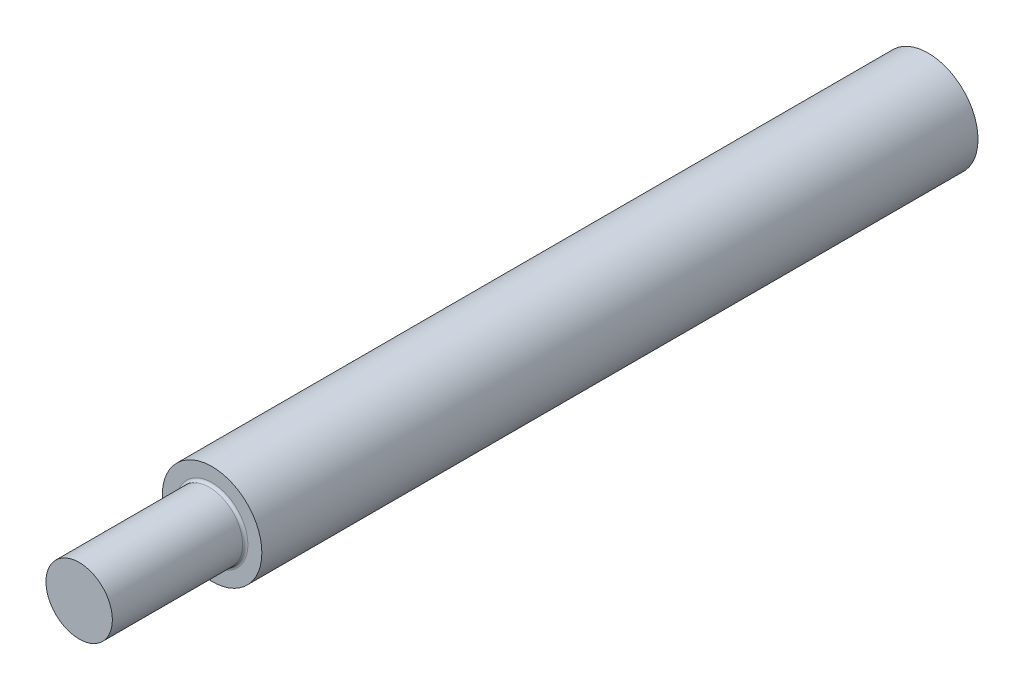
ISO-10303-21;
HEADER;
FILE_DESCRIPTION(('STEP AP214'),'2;1');
FILE_NAME('part.step','',(''),(''),'','','');
FILE_SCHEMA(('AUTOMOTIVE_DESIGN { 1 0 10303 214 1 1 1 1 }'));
ENDSEC;
DATA;
#1=APPLICATION_CONTEXT('core data for automotive mechanical design processes');
#2=APPLICATION_PROTOCOL_DEFINITION('international standard','automotive_design',2000,#1);
#3=PRODUCT_CONTEXT('',#1,'mechanical');
#4=PRODUCT('Part','Part','',(#3));
#5=PRODUCT_RELATED_PRODUCT_CATEGORY('part','',(#4));
#6=PRODUCT_DEFINITION_FORMATION('','',#4);
#7=PRODUCT_DEFINITION_CONTEXT('part definition',#1,'design');
#8=PRODUCT_DEFINITION('design','',#6,#7);
#9=PRODUCT_DEFINITION_SHAPE('','',#8);
#10=(LENGTH_UNIT() NAMED_UNIT(*) SI_UNIT(.MILLI.,.METRE.));
#11=(NAMED_UNIT(*) PLANE_ANGLE_UNIT() SI_UNIT($,.RADIAN.));
#12=(NAMED_UNIT(*) SI_UNIT($,.STERADIAN.) SOLID_ANGLE_UNIT());
#13=UNCERTAINTY_MEASURE_WITH_UNIT(LENGTH_MEASURE(1.E-05),#10,'distance_accuracy_value','');
#14=(GEOMETRIC_REPRESENTATION_CONTEXT(3) GLOBAL_UNCERTAINTY_ASSIGNED_CONTEXT((#13)) GLOBAL_UNIT_ASSIGNED_CONTEXT((#10,
#11,#12)) REPRESENTATION_CONTEXT('',''));
#15=CARTESIAN_POINT('',(0.,0.,0.));
#16=DIRECTION('',(0.,0.,1.));
#17=DIRECTION('',(1.,0.,0.));
#18=AXIS2_PLACEMENT_3D('',#15,#16,#17);
#19=CARTESIAN_POINT('',(0.,0.,68.453));
#20=DIRECTION('',(0.,0.,-1.));
#21=DIRECTION('',(-1.,0.,0.));
#22=AXIS2_PLACEMENT_3D('',#19,#20,#21);
#23=CYLINDRICAL_SURFACE('',#22,4.7625);
#24=CARTESIAN_POINT('',(0.,0.,68.453));
#25=DIRECTION('',(0.,0.,1.));
#26=DIRECTION('',(1.,0.,0.));
#27=AXIS2_PLACEMENT_3D('',#24,#25,#26);
#28=CIRCLE('',#27,4.7625);
#29=CARTESIAN_POINT('',(4.7625,0.,68.453));
#30=VERTEX_POINT('',#29);
#31=EDGE_CURVE('E52',#30,#30,#28,.T.);
#32=ORIENTED_EDGE('',*,*,#31,.F.);
#33=EDGE_LOOP('',(#32));
#34=FACE_BOUND('',#33,.T.);
#35=CARTESIAN_POINT('',(0.,0.,0.));
#36=DIRECTION('',(0.,0.,1.));
#37=DIRECTION('',(1.,0.,0.));
#38=AXIS2_PLACEMENT_3D('',#35,#36,#37);
#39=CIRCLE('',#38,4.7625);
#40=CARTESIAN_POINT('',(4.7625,0.,0.));
#41=VERTEX_POINT('',#40);
#42=EDGE_CURVE('E57',#41,#41,#39,.T.);
#43=ORIENTED_EDGE('',*,*,#42,.T.);
#44=EDGE_LOOP('',(#43));
#45=FACE_BOUND('',#44,.T.);
#46=ADVANCED_FACE('F39',(#34,#45),#23,.T.);
#47=CARTESIAN_POINT('',(0.,0.,68.453));
#48=DIRECTION('',(0.,0.,1.));
#49=DIRECTION('',(1.,0.,0.));
#50=AXIS2_PLACEMENT_3D('',#47,#48,#49);
#51=PLANE('',#50);
#52=CARTESIAN_POINT('',(0.,0.,68.453));
#53=DIRECTION('',(0.,0.,1.));
#54=DIRECTION('',(1.,0.,0.));
#55=AXIS2_PLACEMENT_3D('',#52,#53,#54);
#56=CIRCLE('',#55,3.429);
#57=CARTESIAN_POINT('',(3.429,0.,68.453));
#58=VERTEX_POINT('',#57);
#59=EDGE_CURVE('E10',#58,#58,#56,.F.);
#60=ORIENTED_EDGE('',*,*,#59,.T.);
#61=EDGE_LOOP('',(#60));
#62=FACE_BOUND('',#61,.T.);
#63=ORIENTED_EDGE('',*,*,#31,.T.);
#64=EDGE_LOOP('',(#63));
#65=FACE_BOUND('',#64,.T.);
#66=ADVANCED_FACE('F79',(#62,#65),#51,.T.);
#67=CARTESIAN_POINT('',(0.,0.,0.));
#68=DIRECTION('',(0.,0.,1.));
#69=DIRECTION('',(1.,0.,0.));
#70=AXIS2_PLACEMENT_3D('',#67,#68,#69);
#71=PLANE('',#70);
#72=ORIENTED_EDGE('',*,*,#42,.F.);
#73=EDGE_LOOP('',(#72));
#74=FACE_BOUND('',#73,.T.);
#75=ADVANCED_FACE('F72',(#74),#71,.F.);
#76=CARTESIAN_POINT('',(0.,0.,81.153));
#77=DIRECTION('',(0.,0.,-1.));
#78=DIRECTION('',(-1.,0.,0.));
#79=AXIS2_PLACEMENT_3D('',#76,#77,#78);
#80=CYLINDRICAL_SURFACE('',#79,3.175);
#81=CARTESIAN_POINT('',(0.,0.,68.707));
#82=DIRECTION('',(0.,0.,1.));
#83=DIRECTION('',(1.,0.,0.));
#84=AXIS2_PLACEMENT_3D('',#81,#82,#83);
#85=CIRCLE('',#84,3.175);
#86=CARTESIAN_POINT('',(3.175,0.,68.707));
#87=VERTEX_POINT('',#86);
#88=EDGE_CURVE('E47',#87,#87,#85,.T.);
#89=ORIENTED_EDGE('',*,*,#88,.T.);
#90=EDGE_LOOP('',(#89));
#91=FACE_BOUND('',#90,.T.);
#92=CARTESIAN_POINT('',(0.,0.,81.153));
#93=DIRECTION('',(0.,0.,1.));
#94=DIRECTION('',(1.,0.,0.));
#95=AXIS2_PLACEMENT_3D('',#92,#93,#94);
#96=CIRCLE('',#95,3.175);
#97=CARTESIAN_POINT('',(3.175,0.,81.153));
#98=VERTEX_POINT('',#97);
#99=EDGE_CURVE('E62',#98,#98,#96,.T.);
#100=ORIENTED_EDGE('',*,*,#99,.F.);
#101=EDGE_LOOP('',(#100));
#102=FACE_BOUND('',#101,.T.);
#103=ADVANCED_FACE('F70',(#91,#102),#80,.T.);
#104=CARTESIAN_POINT('',(0.,0.,81.153));
#105=DIRECTION('',(0.,0.,1.));
#106=DIRECTION('',(1.,0.,0.));
#107=AXIS2_PLACEMENT_3D('',#104,#105,#106);
#108=PLANE('',#107);
#109=ORIENTED_EDGE('',*,*,#99,.T.);
#110=EDGE_LOOP('',(#109));
#111=FACE_BOUND('',#110,.T.);
#112=ADVANCED_FACE('F68',(#111),#108,.T.);
#113=CARTESIAN_POINT('',(0.,0.,68.707));
#114=DIRECTION('',(0.,0.,1.));
#115=DIRECTION('',(1.,0.,0.));
#116=AXIS2_PLACEMENT_3D('',#113,#114,#115);
#117=TOROIDAL_SURFACE('',#116,3.429,0.254);
#118=ORIENTED_EDGE('',*,*,#59,.F.);
#119=EDGE_LOOP('',(#118));
#120=FACE_BOUND('',#119,.T.);
#121=ORIENTED_EDGE('',*,*,#88,.F.);
#122=EDGE_LOOP('',(#121));
#123=FACE_BOUND('',#122,.T.);
#124=ADVANCED_FACE('F41',(#120,#123),#117,.F.);
#125=CLOSED_SHELL('',(#46,#66,#75,#103,#112,#124));
#126=MANIFOLD_SOLID_BREP('B2',#125);
#127=ADVANCED_BREP_SHAPE_REPRESENTATION('',(#18,#126),#14);
#128=SHAPE_DEFINITION_REPRESENTATION(#9,#127);
ENDSEC;
END-ISO-10303-21;
